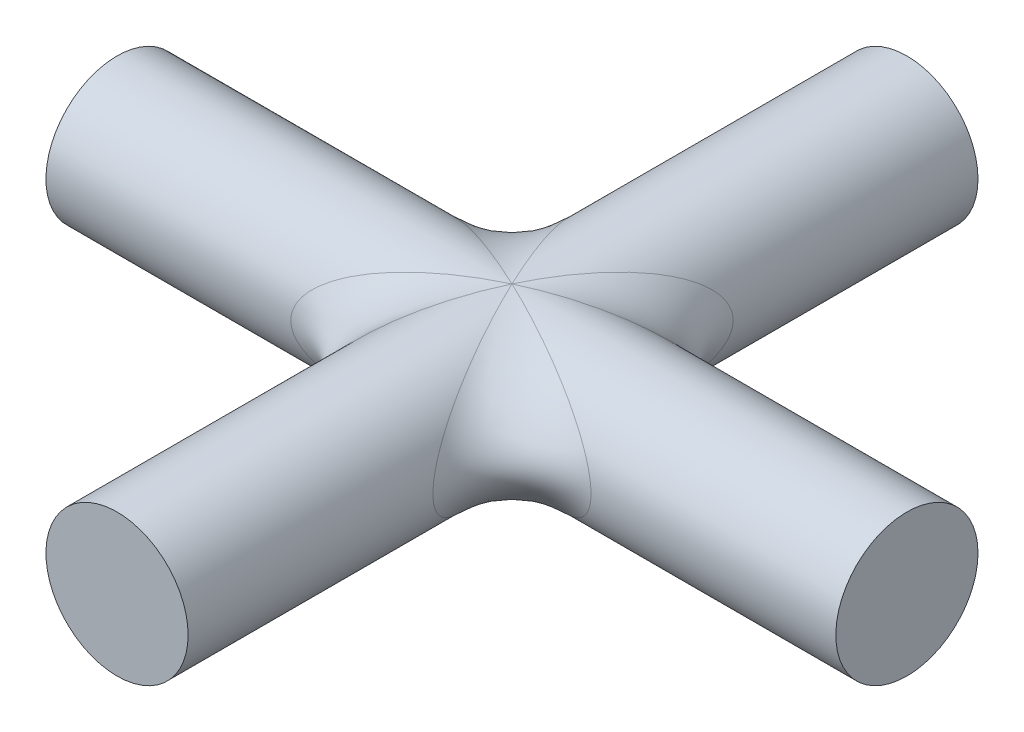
ISO-10303-21;
HEADER;
FILE_DESCRIPTION(('STEP AP214'),'2;1');
FILE_NAME('part.step','',(''),(''),'','','');
FILE_SCHEMA(('AUTOMOTIVE_DESIGN { 1 0 10303 214 1 1 1 1 }'));
ENDSEC;
DATA;
#1=APPLICATION_CONTEXT('core data for automotive mechanical design processes');
#2=APPLICATION_PROTOCOL_DEFINITION('international standard','automotive_design',2000,#1);
#3=PRODUCT_CONTEXT('',#1,'mechanical');
#4=PRODUCT('Part','Part','',(#3));
#5=PRODUCT_RELATED_PRODUCT_CATEGORY('part','',(#4));
#6=PRODUCT_DEFINITION_FORMATION('','',#4);
#7=PRODUCT_DEFINITION_CONTEXT('part definition',#1,'design');
#8=PRODUCT_DEFINITION('design','',#6,#7);
#9=PRODUCT_DEFINITION_SHAPE('','',#8);
#10=(LENGTH_UNIT() NAMED_UNIT(*) SI_UNIT(.MILLI.,.METRE.));
#11=(NAMED_UNIT(*) PLANE_ANGLE_UNIT() SI_UNIT($,.RADIAN.));
#12=(NAMED_UNIT(*) SI_UNIT($,.STERADIAN.) SOLID_ANGLE_UNIT());
#13=UNCERTAINTY_MEASURE_WITH_UNIT(LENGTH_MEASURE(1.E-05),#10,'distance_accuracy_value','');
#14=(GEOMETRIC_REPRESENTATION_CONTEXT(3) GLOBAL_UNCERTAINTY_ASSIGNED_CONTEXT((#13)) GLOBAL_UNIT_ASSIGNED_CONTEXT((#10,
#11,#12)) REPRESENTATION_CONTEXT('',''));
#15=CARTESIAN_POINT('',(0.,0.,0.));
#16=DIRECTION('',(0.,0.,1.));
#17=DIRECTION('',(1.,0.,0.));
#18=AXIS2_PLACEMENT_3D('',#15,#16,#17);
#19=CARTESIAN_POINT('',(12.7,0.,0.));
#20=DIRECTION('',(-1.,0.,0.));
#21=DIRECTION('',(0.,0.,1.));
#22=AXIS2_PLACEMENT_3D('',#19,#20,#21);
#23=CYLINDRICAL_SURFACE('',#22,2.286);
#24=CARTESIAN_POINT('',(12.7,0.,0.));
#25=DIRECTION('',(1.,0.,0.));
#26=DIRECTION('',(0.,0.,-1.));
#27=AXIS2_PLACEMENT_3D('',#24,#25,#26);
#28=CIRCLE('',#27,2.286);
#29=CARTESIAN_POINT('',(12.7,0.,-2.286));
#30=VERTEX_POINT('',#29);
#31=EDGE_CURVE('E89',#30,#30,#28,.T.);
#32=ORIENTED_EDGE('',*,*,#31,.F.);
#33=EDGE_LOOP('',(#32));
#34=FACE_BOUND('',#33,.T.);
#35=CARTESIAN_POINT('',(0.,0.,0.));
#36=DIRECTION('',(-0.428086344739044,0.,0.903737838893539));
#37=DIRECTION('',(-0.903737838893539,0.,-0.428086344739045));
#38=AXIS2_PLACEMENT_3D('',#35,#36,#37);
#39=ELLIPSE('',#38,5.34004419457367,2.286);
#40=CARTESIAN_POINT('',(0.,2.286,0.));
#41=VERTEX_POINT('',#40);
#42=CARTESIAN_POINT('',(0.,-2.286,0.));
#43=VERTEX_POINT('',#42);
#44=EDGE_CURVE('E72',#41,#43,#39,.F.);
#45=ORIENTED_EDGE('',*,*,#44,.T.);
#46=CARTESIAN_POINT('',(0.,0.,0.));
#47=DIRECTION('',(0.428086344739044,0.,0.903737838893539));
#48=DIRECTION('',(0.903737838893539,0.,-0.428086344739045));
#49=AXIS2_PLACEMENT_3D('',#46,#47,#48);
#50=ELLIPSE('',#49,5.34004419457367,2.286);
#51=EDGE_CURVE('E65',#43,#41,#50,.T.);
#52=ORIENTED_EDGE('',*,*,#51,.T.);
#53=EDGE_LOOP('',(#45,#52));
#54=FACE_BOUND('',#53,.T.);
#55=ADVANCED_FACE('F32',(#34,#54),#23,.T.);
#56=CARTESIAN_POINT('',(12.7,0.,0.));
#57=DIRECTION('',(1.,0.,0.));
#58=DIRECTION('',(0.,0.,-1.));
#59=AXIS2_PLACEMENT_3D('',#56,#57,#58);
#60=PLANE('',#59);
#61=ORIENTED_EDGE('',*,*,#31,.T.);
#62=EDGE_LOOP('',(#61));
#63=FACE_BOUND('',#62,.T.);
#64=ADVANCED_FACE('F116',(#63),#60,.T.);
#65=CARTESIAN_POINT('',(0.,0.,-12.7));
#66=DIRECTION('',(0.,0.,1.));
#67=DIRECTION('',(1.,0.,0.));
#68=AXIS2_PLACEMENT_3D('',#65,#66,#67);
#69=PLANE('',#68);
#70=CARTESIAN_POINT('',(0.,0.,-12.7));
#71=DIRECTION('',(0.,0.,1.));
#72=DIRECTION('',(1.,0.,0.));
#73=AXIS2_PLACEMENT_3D('',#70,#71,#72);
#74=CIRCLE('',#73,2.286);
#75=CARTESIAN_POINT('',(2.286,0.,-12.7));
#76=VERTEX_POINT('',#75);
#77=EDGE_CURVE('E146',#76,#76,#74,.T.);
#78=ORIENTED_EDGE('',*,*,#77,.F.);
#79=EDGE_LOOP('',(#78));
#80=FACE_BOUND('',#79,.T.);
#81=ADVANCED_FACE('F114',(#80),#69,.F.);
#82=CARTESIAN_POINT('',(0.,0.,12.7));
#83=DIRECTION('',(0.,0.,-1.));
#84=DIRECTION('',(-1.,0.,0.));
#85=AXIS2_PLACEMENT_3D('',#82,#83,#84);
#86=CYLINDRICAL_SURFACE('',#85,2.286);
#87=ORIENTED_EDGE('',*,*,#77,.T.);
#88=EDGE_LOOP('',(#87));
#89=FACE_BOUND('',#88,.T.);
#90=CARTESIAN_POINT('',(0.,0.,0.));
#91=DIRECTION('',(-0.903737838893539,0.,0.428086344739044));
#92=DIRECTION('',(-0.428086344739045,0.,-0.903737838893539));
#93=AXIS2_PLACEMENT_3D('',#90,#91,#92);
#94=ELLIPSE('',#93,5.34004419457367,2.286);
#95=EDGE_CURVE('E85',#43,#41,#94,.F.);
#96=ORIENTED_EDGE('',*,*,#95,.T.);
#97=CARTESIAN_POINT('',(0.,0.,0.));
#98=DIRECTION('',(0.903737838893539,0.,0.428086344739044));
#99=DIRECTION('',(0.428086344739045,0.,-0.903737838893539));
#100=AXIS2_PLACEMENT_3D('',#97,#98,#99);
#101=ELLIPSE('',#100,5.34004419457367,2.286);
#102=EDGE_CURVE('E68',#41,#43,#101,.F.);
#103=ORIENTED_EDGE('',*,*,#102,.T.);
#104=EDGE_LOOP('',(#96,#103));
#105=FACE_BOUND('',#104,.T.);
#106=ADVANCED_FACE('F84',(#89,#105),#86,.T.);
#107=CARTESIAN_POINT('',(-12.7,0.,0.));
#108=DIRECTION('',(1.,0.,0.));
#109=DIRECTION('',(0.,0.,-1.));
#110=AXIS2_PLACEMENT_3D('',#107,#108,#109);
#111=PLANE('',#110);
#112=CARTESIAN_POINT('',(-12.7,0.,0.));
#113=DIRECTION('',(1.,0.,0.));
#114=DIRECTION('',(0.,0.,-1.));
#115=AXIS2_PLACEMENT_3D('',#112,#113,#114);
#116=CIRCLE('',#115,2.286);
#117=CARTESIAN_POINT('',(-12.7,0.,-2.286));
#118=VERTEX_POINT('',#117);
#119=EDGE_CURVE('E92',#118,#118,#116,.T.);
#120=ORIENTED_EDGE('',*,*,#119,.F.);
#121=EDGE_LOOP('',(#120));
#122=FACE_BOUND('',#121,.T.);
#123=ADVANCED_FACE('F136',(#122),#111,.F.);
#124=ORIENTED_EDGE('',*,*,#119,.T.);
#125=EDGE_LOOP('',(#124));
#126=FACE_BOUND('',#125,.T.);
#127=CARTESIAN_POINT('',(0.,0.,0.));
#128=DIRECTION('',(-0.428086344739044,0.,0.903737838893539));
#129=DIRECTION('',(-0.903737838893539,0.,-0.428086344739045));
#130=AXIS2_PLACEMENT_3D('',#127,#128,#129);
#131=ELLIPSE('',#130,5.34004419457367,2.286);
#132=EDGE_CURVE('E45',#41,#43,#131,.T.);
#133=ORIENTED_EDGE('',*,*,#132,.T.);
#134=CARTESIAN_POINT('',(0.,0.,0.));
#135=DIRECTION('',(0.428086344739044,0.,0.903737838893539));
#136=DIRECTION('',(0.903737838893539,0.,-0.428086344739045));
#137=AXIS2_PLACEMENT_3D('',#134,#135,#136);
#138=ELLIPSE('',#137,5.34004419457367,2.286);
#139=EDGE_CURVE('E11',#43,#41,#138,.F.);
#140=ORIENTED_EDGE('',*,*,#139,.T.);
#141=EDGE_LOOP('',(#133,#140));
#142=FACE_BOUND('',#141,.T.);
#143=ADVANCED_FACE('F74',(#126,#142),#23,.T.);
#144=CARTESIAN_POINT('',(0.,0.,12.7));
#145=DIRECTION('',(0.,0.,1.));
#146=DIRECTION('',(1.,0.,0.));
#147=AXIS2_PLACEMENT_3D('',#144,#145,#146);
#148=CIRCLE('',#147,2.286);
#149=CARTESIAN_POINT('',(2.286,0.,12.7));
#150=VERTEX_POINT('',#149);
#151=EDGE_CURVE('E144',#150,#150,#148,.T.);
#152=ORIENTED_EDGE('',*,*,#151,.F.);
#153=EDGE_LOOP('',(#152));
#154=FACE_BOUND('',#153,.T.);
#155=CARTESIAN_POINT('',(0.,0.,0.));
#156=DIRECTION('',(0.903737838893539,0.,0.428086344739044));
#157=DIRECTION('',(0.428086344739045,0.,-0.903737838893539));
#158=AXIS2_PLACEMENT_3D('',#155,#156,#157);
#159=ELLIPSE('',#158,5.34004419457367,2.286);
#160=EDGE_CURVE('E59',#41,#43,#159,.T.);
#161=ORIENTED_EDGE('',*,*,#160,.T.);
#162=CARTESIAN_POINT('',(0.,0.,0.));
#163=DIRECTION('',(-0.903737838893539,0.,0.428086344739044));
#164=DIRECTION('',(-0.428086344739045,0.,-0.903737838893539));
#165=AXIS2_PLACEMENT_3D('',#162,#163,#164);
#166=ELLIPSE('',#165,5.34004419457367,2.286);
#167=EDGE_CURVE('E75',#43,#41,#166,.T.);
#168=ORIENTED_EDGE('',*,*,#167,.T.);
#169=EDGE_LOOP('',(#161,#168));
#170=FACE_BOUND('',#169,.T.);
#171=ADVANCED_FACE('F78',(#154,#170),#86,.T.);
#172=CARTESIAN_POINT('',(0.,0.,12.7));
#173=DIRECTION('',(0.,0.,1.));
#174=DIRECTION('',(1.,0.,0.));
#175=AXIS2_PLACEMENT_3D('',#172,#173,#174);
#176=PLANE('',#175);
#177=ORIENTED_EDGE('',*,*,#151,.T.);
#178=EDGE_LOOP('',(#177));
#179=FACE_BOUND('',#178,.T.);
#180=ADVANCED_FACE('F104',(#179),#176,.T.);
#181=CARTESIAN_POINT('',(0.,2.286,0.));
#182=CARTESIAN_POINT('',(0.,2.286,0.));
#183=CARTESIAN_POINT('',(0.,2.286,0.));
#184=CARTESIAN_POINT('',(0.0995890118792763,2.28595993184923,-0.210243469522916));
#185=CARTESIAN_POINT('',(0.154947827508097,2.28631550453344,-0.154947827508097));
#186=CARTESIAN_POINT('',(0.210243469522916,2.28595993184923,-0.0995890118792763));
#187=CARTESIAN_POINT('',(0.199203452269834,2.27948891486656,-0.420540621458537));
#188=CARTESIAN_POINT('',(0.310320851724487,2.2722519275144,-0.310320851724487));
#189=CARTESIAN_POINT('',(0.420540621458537,2.27948891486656,-0.199203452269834));
#190=CARTESIAN_POINT('',(0.396719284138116,2.25350788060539,-0.837518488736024));
#191=CARTESIAN_POINT('',(0.614699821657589,2.21743937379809,-0.61469982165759));
#192=CARTESIAN_POINT('',(0.837518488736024,2.25350788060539,-0.396719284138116));
#193=CARTESIAN_POINT('',(0.494628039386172,2.23410916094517,-1.04421474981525));
#194=CARTESIAN_POINT('',(0.764584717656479,2.17661121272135,-0.764584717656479));
#195=CARTESIAN_POINT('',(1.04421474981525,2.23410916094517,-0.494628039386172));
#196=CARTESIAN_POINT('',(0.687065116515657,2.18253985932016,-1.45047080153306));
#197=CARTESIAN_POINT('',(1.05254183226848,2.06985742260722,-1.05254183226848));
#198=CARTESIAN_POINT('',(1.45047080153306,2.18253985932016,-0.687065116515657));
#199=CARTESIAN_POINT('',(0.781622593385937,2.15058895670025,-1.65009214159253));
#200=CARTESIAN_POINT('',(1.19148213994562,2.00377565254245,-1.19148213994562));
#201=CARTESIAN_POINT('',(1.65009214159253,2.15058895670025,-0.781622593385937));
#202=CARTESIAN_POINT('',(0.965710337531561,2.07433916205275,-2.03872182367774));
#203=CARTESIAN_POINT('',(1.4522802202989,1.85002940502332,-1.4522802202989));
#204=CARTESIAN_POINT('',(2.03872182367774,2.07433916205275,-0.965710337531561));
#205=CARTESIAN_POINT('',(1.05530706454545,2.0303638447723,-2.22787046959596));
#206=CARTESIAN_POINT('',(1.57497814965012,1.76213109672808,-1.57497814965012));
#207=CARTESIAN_POINT('',(2.22787046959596,2.0303638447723,-1.05530706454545));
#208=CARTESIAN_POINT('',(1.22790166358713,1.93071585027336,-2.5922368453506));
#209=CARTESIAN_POINT('',(1.79838930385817,1.5698860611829,-1.79838930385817));
#210=CARTESIAN_POINT('',(2.5922368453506,1.93071585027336,-1.22790166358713));
#211=CARTESIAN_POINT('',(1.3110188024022,1.87546005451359,-2.76770636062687));
#212=CARTESIAN_POINT('',(1.89989369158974,1.46523612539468,-1.89989369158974));
#213=CARTESIAN_POINT('',(2.76770636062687,1.87546005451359,-1.3110188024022));
#214=CARTESIAN_POINT('',(1.46917579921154,1.75410148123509,-3.10159335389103));
#215=CARTESIAN_POINT('',(2.0767997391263,1.2467527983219,-2.0767997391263));
#216=CARTESIAN_POINT('',(3.10159335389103,1.75410148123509,-1.46917579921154));
#217=CARTESIAN_POINT('',(1.5444025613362,1.68849058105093,-3.26040540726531));
#218=CARTESIAN_POINT('',(2.15291515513,1.13256557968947,-2.15291515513));
#219=CARTESIAN_POINT('',(3.26040540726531,1.68849058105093,-1.5444025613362));
#220=CARTESIAN_POINT('',(1.6854204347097,1.54747087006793,-3.55810980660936));
#221=CARTESIAN_POINT('',(2.27645124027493,0.904607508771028,-2.27645124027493));
#222=CARTESIAN_POINT('',(3.55810980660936,1.54747087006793,-1.6854204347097));
#223=CARTESIAN_POINT('',(1.75147699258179,1.47259855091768,-3.69756253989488));
#224=CARTESIAN_POINT('',(2.3244785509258,0.790466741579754,-2.3244785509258));
#225=CARTESIAN_POINT('',(3.69756253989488,1.47259855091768,-1.75147699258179));
#226=CARTESIAN_POINT('',(1.87294191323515,1.31429814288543,-3.95398848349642));
#227=CARTESIAN_POINT('',(2.39194381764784,0.574280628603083,-2.39194381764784));
#228=CARTESIAN_POINT('',(3.95398848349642,1.31429814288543,-1.87294191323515));
#229=CARTESIAN_POINT('',(1.92869543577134,1.23140588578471,-4.07169036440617));
#230=CARTESIAN_POINT('',(2.41186019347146,0.471896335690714,-2.41186019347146));
#231=CARTESIAN_POINT('',(4.07169036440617,1.23140588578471,-1.92869543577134));
#232=CARTESIAN_POINT('',(2.028518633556,1.05849848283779,-4.28242822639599));
#233=CARTESIAN_POINT('',(2.42737400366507,0.291450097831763,-2.42737400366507));
#234=CARTESIAN_POINT('',(4.28242822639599,1.05849848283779,-2.028518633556));
#235=CARTESIAN_POINT('',(2.07299557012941,0.968959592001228,-4.37632398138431));
#236=CARTESIAN_POINT('',(2.42332089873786,0.213124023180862,-2.42332089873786));
#237=CARTESIAN_POINT('',(4.37632398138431,0.968959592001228,-2.07299557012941));
#238=CARTESIAN_POINT('',(2.14944639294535,0.784375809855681,-4.53772016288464));
#239=CARTESIAN_POINT('',(2.40032956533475,0.0899469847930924,-2.40032956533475));
#240=CARTESIAN_POINT('',(4.53772016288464,0.784375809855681,-2.14944639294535));
#241=CARTESIAN_POINT('',(2.18184360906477,0.689686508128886,-4.60611428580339));
#242=CARTESIAN_POINT('',(2.38163398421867,0.0449196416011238,-2.38163398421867));
#243=CARTESIAN_POINT('',(4.60611428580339,0.689686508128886,-2.18184360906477));
#244=CARTESIAN_POINT('',(2.23358068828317,0.496577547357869,-4.71533700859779));
#245=CARTESIAN_POINT('',(2.34283679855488,-0.011028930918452,-2.34283679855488));
#246=CARTESIAN_POINT('',(4.71533700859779,0.496577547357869,-2.23358068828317));
#247=CARTESIAN_POINT('',(2.25328340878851,0.39835526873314,-4.75693164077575));
#248=CARTESIAN_POINT('',(2.32289795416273,-0.0220726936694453,-2.32289795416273));
#249=CARTESIAN_POINT('',(4.75693164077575,0.39835526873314,-2.25328340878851));
#250=CARTESIAN_POINT('',(2.27938659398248,0.200050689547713,-4.81203836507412));
#251=CARTESIAN_POINT('',(2.29443556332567,-0.0220195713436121,-2.29443556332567));
#252=CARTESIAN_POINT('',(4.81203836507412,0.200050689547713,-2.27938659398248));
#253=CARTESIAN_POINT('',(2.286,0.100025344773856,-4.826));
#254=CARTESIAN_POINT('',(2.286,-0.0110419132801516,-2.286));
#255=CARTESIAN_POINT('',(4.826,0.100025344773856,-2.286));
#256=CARTESIAN_POINT('',(2.286,-0.100025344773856,-4.826));
#257=CARTESIAN_POINT('',(2.286,0.0110419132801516,-2.286));
#258=CARTESIAN_POINT('',(4.826,-0.100025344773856,-2.286));
#259=CARTESIAN_POINT('',(2.27938659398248,-0.200050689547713,-4.81203836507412));
#260=CARTESIAN_POINT('',(2.29443556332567,0.0220195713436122,-2.29443556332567));
#261=CARTESIAN_POINT('',(4.81203836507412,-0.200050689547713,-2.27938659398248));
#262=CARTESIAN_POINT('',(2.25328340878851,-0.398355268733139,-4.75693164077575));
#263=CARTESIAN_POINT('',(2.32289795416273,0.0220726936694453,-2.32289795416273));
#264=CARTESIAN_POINT('',(4.75693164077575,-0.398355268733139,-2.25328340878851));
#265=CARTESIAN_POINT('',(2.23358068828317,-0.496577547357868,-4.71533700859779));
#266=CARTESIAN_POINT('',(2.34283679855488,0.0110289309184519,-2.34283679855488));
#267=CARTESIAN_POINT('',(4.71533700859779,-0.496577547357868,-2.23358068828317));
#268=CARTESIAN_POINT('',(2.18184360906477,-0.689686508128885,-4.60611428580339));
#269=CARTESIAN_POINT('',(2.38163398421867,-0.0449196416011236,-2.38163398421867));
#270=CARTESIAN_POINT('',(4.60611428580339,-0.689686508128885,-2.18184360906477));
#271=CARTESIAN_POINT('',(2.14944639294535,-0.784375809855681,-4.53772016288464));
#272=CARTESIAN_POINT('',(2.40032956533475,-0.0899469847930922,-2.40032956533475));
#273=CARTESIAN_POINT('',(4.53772016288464,-0.784375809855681,-2.14944639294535));
#274=CARTESIAN_POINT('',(2.07299557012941,-0.968959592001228,-4.37632398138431));
#275=CARTESIAN_POINT('',(2.42332089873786,-0.213124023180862,-2.42332089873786));
#276=CARTESIAN_POINT('',(4.37632398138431,-0.968959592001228,-2.07299557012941));
#277=CARTESIAN_POINT('',(2.028518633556,-1.05849848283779,-4.28242822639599));
#278=CARTESIAN_POINT('',(2.42737400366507,-0.291450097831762,-2.42737400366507));
#279=CARTESIAN_POINT('',(4.28242822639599,-1.05849848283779,-2.028518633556));
#280=CARTESIAN_POINT('',(1.92869543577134,-1.23140588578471,-4.07169036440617));
#281=CARTESIAN_POINT('',(2.41186019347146,-0.471896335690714,-2.41186019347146));
#282=CARTESIAN_POINT('',(4.07169036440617,-1.23140588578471,-1.92869543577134));
#283=CARTESIAN_POINT('',(1.87294191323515,-1.31429814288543,-3.95398848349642));
#284=CARTESIAN_POINT('',(2.39194381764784,-0.574280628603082,-2.39194381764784));
#285=CARTESIAN_POINT('',(3.95398848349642,-1.31429814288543,-1.87294191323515));
#286=CARTESIAN_POINT('',(1.75147699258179,-1.47259855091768,-3.69756253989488));
#287=CARTESIAN_POINT('',(2.3244785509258,-0.790466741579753,-2.3244785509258));
#288=CARTESIAN_POINT('',(3.69756253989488,-1.47259855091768,-1.75147699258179));
#289=CARTESIAN_POINT('',(1.6854204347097,-1.54747087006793,-3.55810980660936));
#290=CARTESIAN_POINT('',(2.27645124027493,-0.904607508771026,-2.27645124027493));
#291=CARTESIAN_POINT('',(3.55810980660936,-1.54747087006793,-1.6854204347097));
#292=CARTESIAN_POINT('',(1.5444025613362,-1.68849058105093,-3.26040540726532));
#293=CARTESIAN_POINT('',(2.15291515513,-1.13256557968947,-2.15291515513));
#294=CARTESIAN_POINT('',(3.26040540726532,-1.68849058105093,-1.5444025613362));
#295=CARTESIAN_POINT('',(1.46917579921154,-1.75410148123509,-3.10159335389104));
#296=CARTESIAN_POINT('',(2.0767997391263,-1.2467527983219,-2.0767997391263));
#297=CARTESIAN_POINT('',(3.10159335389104,-1.75410148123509,-1.46917579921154));
#298=CARTESIAN_POINT('',(1.3110188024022,-1.87546005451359,-2.76770636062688));
#299=CARTESIAN_POINT('',(1.89989369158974,-1.46523612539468,-1.89989369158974));
#300=CARTESIAN_POINT('',(2.76770636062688,-1.87546005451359,-1.3110188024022));
#301=CARTESIAN_POINT('',(1.22790166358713,-1.93071585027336,-2.5922368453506));
#302=CARTESIAN_POINT('',(1.79838930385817,-1.5698860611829,-1.79838930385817));
#303=CARTESIAN_POINT('',(2.5922368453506,-1.93071585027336,-1.22790166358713));
#304=CARTESIAN_POINT('',(1.05530706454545,-2.0303638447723,-2.22787046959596));
#305=CARTESIAN_POINT('',(1.57497814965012,-1.76213109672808,-1.57497814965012));
#306=CARTESIAN_POINT('',(2.22787046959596,-2.0303638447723,-1.05530706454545));
#307=CARTESIAN_POINT('',(0.965710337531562,-2.07433916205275,-2.03872182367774));
#308=CARTESIAN_POINT('',(1.4522802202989,-1.85002940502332,-1.4522802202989));
#309=CARTESIAN_POINT('',(2.03872182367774,-2.07433916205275,-0.965710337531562));
#310=CARTESIAN_POINT('',(0.781622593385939,-2.15058895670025,-1.65009214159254));
#311=CARTESIAN_POINT('',(1.19148213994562,-2.00377565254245,-1.19148213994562));
#312=CARTESIAN_POINT('',(1.65009214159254,-2.15058895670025,-0.781622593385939));
#313=CARTESIAN_POINT('',(0.687065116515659,-2.18253985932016,-1.45047080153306));
#314=CARTESIAN_POINT('',(1.05254183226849,-2.06985742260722,-1.05254183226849));
#315=CARTESIAN_POINT('',(1.45047080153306,-2.18253985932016,-0.687065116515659));
#316=CARTESIAN_POINT('',(0.494628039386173,-2.23410916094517,-1.04421474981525));
#317=CARTESIAN_POINT('',(0.764584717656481,-2.17661121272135,-0.764584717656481));
#318=CARTESIAN_POINT('',(1.04421474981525,-2.23410916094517,-0.494628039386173));
#319=CARTESIAN_POINT('',(0.396719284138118,-2.25350788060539,-0.837518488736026));
#320=CARTESIAN_POINT('',(0.614699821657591,-2.21743937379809,-0.614699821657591));
#321=CARTESIAN_POINT('',(0.837518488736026,-2.25350788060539,-0.396719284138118));
#322=CARTESIAN_POINT('',(0.199203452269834,-2.27948891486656,-0.420540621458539));
#323=CARTESIAN_POINT('',(0.310320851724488,-2.2722519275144,-0.310320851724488));
#324=CARTESIAN_POINT('',(0.420540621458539,-2.27948891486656,-0.199203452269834));
#325=CARTESIAN_POINT('',(0.0995890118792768,-2.28595993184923,-0.210243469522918));
#326=CARTESIAN_POINT('',(0.154947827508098,-2.28631550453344,-0.154947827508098));
#327=CARTESIAN_POINT('',(0.210243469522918,-2.28595993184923,-0.0995890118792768));
#328=CARTESIAN_POINT('',(0.,-2.286,0.));
#329=CARTESIAN_POINT('',(0.,-2.286,0.));
#330=CARTESIAN_POINT('',(0.,-2.286,0.));
#331=(BOUNDED_SURFACE() B_SPLINE_SURFACE(3,2,((#181,#182,#183),(#184,#185,#186),(#187,#188,
#189),(#190,#191,#192),(#193,#194,#195),(#196,#197,#198),(#199,#200,#201),(#202,#203,#204),
(#205,#206,#207),(#208,#209,#210),(#211,#212,#213),(#214,#215,#216),(#217,#218,#219),(#220,#221,
#222),(#223,#224,#225),(#226,#227,#228),(#229,#230,#231),(#232,#233,#234),(#235,#236,#237),
(#238,#239,#240),(#241,#242,#243),(#244,#245,#246),(#247,#248,#249),(#250,#251,#252),(#253,#254,
#255),(#256,#257,#258),(#259,#260,#261),(#262,#263,#264),(#265,#266,#267),(#268,#269,#270),
(#271,#272,#273),(#274,#275,#276),(#277,#278,#279),(#280,#281,#282),(#283,#284,#285),(#286,#287,
#288),(#289,#290,#291),(#292,#293,#294),(#295,#296,#297),(#298,#299,#300),(#301,#302,#303),
(#304,#305,#306),(#307,#308,#309),(#310,#311,#312),(#313,#314,#315),(#316,#317,#318),(#319,#320,
#321),(#322,#323,#324),(#325,#326,#327),(#328,#329,#330)),.UNSPECIFIED.,.F.,.F.,
.F.) B_SPLINE_SURFACE_WITH_KNOTS((4,2,2,2,2,2,2,2,2,2,2,2,2,2,2,2,2,2,2,2,2,2,2,2,4),(3,3),(0.,
0.89179680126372,1.77601342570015,2.64539912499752,3.4933680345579,4.31434603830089,
5.10413218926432,5.86027177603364,6.58242436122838,7.27268370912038,7.93576571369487,
8.57893769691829,9.21155741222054,9.84417712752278,10.4873491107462,11.1504311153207,
11.8406904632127,12.5628430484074,13.3189826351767,14.1087687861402,14.9297467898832,
15.7777156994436,16.6471013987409,17.5313180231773,18.4231148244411),(0.,1.),
.UNSPECIFIED.) GEOMETRIC_REPRESENTATION_ITEM() RATIONAL_B_SPLINE_SURFACE(((1.,1.,1.),(1.,
1.00000566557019,1.),(1.,0.998576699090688,1.),(1.,0.992910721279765,1.),(1.,0.988697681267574,
1.),(1.,0.97761712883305,1.),(1.,0.970795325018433,1.),(1.,0.954789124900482,1.),(1.,
0.945667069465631,1.),(1.,0.925487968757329,1.),(1.,0.914501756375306,1.),(1.,0.891169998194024,
1.),(1.,0.878891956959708,1.),(1.,0.853706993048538,1.),(1.,0.84084914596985,1.),(1.,
0.815387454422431,1.),(1.,0.802798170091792,1.),(1.,0.778880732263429,1.),(1.,0.767521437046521,
1.),(1.,0.747118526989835,1.),(1.,0.738001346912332,1.),(1.,0.723039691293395,1.),(1.,
0.717105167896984,1.),(1.,0.709170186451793,1.),(1.,0.707106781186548,1.),(1.,0.707106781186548,
1.),(1.,0.709170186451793,1.),(1.,0.717105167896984,1.),(1.,0.723039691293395,1.),(1.,
0.738001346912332,1.),(1.,0.747118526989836,1.),(1.,0.767521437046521,1.),(1.,0.778880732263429,
1.),(1.,0.802798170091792,1.),(1.,0.815387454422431,1.),(1.,0.84084914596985,1.),(1.,
0.853706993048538,1.),(1.,0.878891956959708,1.),(1.,0.891169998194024,1.),(1.,0.914501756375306,
1.),(1.,0.925487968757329,1.),(1.,0.945667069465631,1.),(1.,0.954789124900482,1.),(1.,
0.970795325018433,1.),(1.,0.97761712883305,1.),(1.,0.988697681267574,1.),(1.,0.992910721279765,
1.),(1.,0.998576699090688,1.),(1.,1.00000566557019,1.),(1.,1.,1.))) REPRESENTATION_ITEM('') SURFACE());
#332=ORIENTED_EDGE('',*,*,#102,.F.);
#333=ORIENTED_EDGE('',*,*,#51,.F.);
#334=EDGE_LOOP('',(#332,#333));
#335=FACE_BOUND('',#334,.T.);
#336=ADVANCED_FACE('F66',(#335),#331,.F.);
#337=CARTESIAN_POINT('',(0.,2.286,0.));
#338=CARTESIAN_POINT('',(0.,2.286,0.));
#339=CARTESIAN_POINT('',(0.,2.286,0.));
#340=CARTESIAN_POINT('',(0.210243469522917,2.28595993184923,0.0995890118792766));
#341=CARTESIAN_POINT('',(0.154947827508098,2.28631550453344,0.154947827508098));
#342=CARTESIAN_POINT('',(0.0995890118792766,2.28595993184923,0.210243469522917));
#343=CARTESIAN_POINT('',(0.420540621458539,2.27948891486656,0.199203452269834));
#344=CARTESIAN_POINT('',(0.310320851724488,2.2722519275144,0.310320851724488));
#345=CARTESIAN_POINT('',(0.199203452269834,2.27948891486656,0.420540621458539));
#346=CARTESIAN_POINT('',(0.837518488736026,2.25350788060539,0.396719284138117));
#347=CARTESIAN_POINT('',(0.614699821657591,2.21743937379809,0.614699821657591));
#348=CARTESIAN_POINT('',(0.396719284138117,2.25350788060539,0.837518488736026));
#349=CARTESIAN_POINT('',(1.04421474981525,2.23410916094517,0.494628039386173));
#350=CARTESIAN_POINT('',(0.764584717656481,2.17661121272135,0.764584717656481));
#351=CARTESIAN_POINT('',(0.494628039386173,2.23410916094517,1.04421474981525));
#352=CARTESIAN_POINT('',(1.45047080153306,2.18253985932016,0.687065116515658));
#353=CARTESIAN_POINT('',(1.05254183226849,2.06985742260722,1.05254183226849));
#354=CARTESIAN_POINT('',(0.687065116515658,2.18253985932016,1.45047080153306));
#355=CARTESIAN_POINT('',(1.65009214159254,2.15058895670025,0.781622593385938));
#356=CARTESIAN_POINT('',(1.19148213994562,2.00377565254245,1.19148213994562));
#357=CARTESIAN_POINT('',(0.781622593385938,2.15058895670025,1.65009214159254));
#358=CARTESIAN_POINT('',(2.03872182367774,2.07433916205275,0.965710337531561));
#359=CARTESIAN_POINT('',(1.4522802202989,1.85002940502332,1.4522802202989));
#360=CARTESIAN_POINT('',(0.965710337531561,2.07433916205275,2.03872182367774));
#361=CARTESIAN_POINT('',(2.22787046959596,2.0303638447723,1.05530706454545));
#362=CARTESIAN_POINT('',(1.57497814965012,1.76213109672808,1.57497814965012));
#363=CARTESIAN_POINT('',(1.05530706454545,2.0303638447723,2.22787046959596));
#364=CARTESIAN_POINT('',(2.5922368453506,1.93071585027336,1.22790166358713));
#365=CARTESIAN_POINT('',(1.79838930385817,1.5698860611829,1.79838930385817));
#366=CARTESIAN_POINT('',(1.22790166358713,1.93071585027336,2.5922368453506));
#367=CARTESIAN_POINT('',(2.76770636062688,1.87546005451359,1.3110188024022));
#368=CARTESIAN_POINT('',(1.89989369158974,1.46523612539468,1.89989369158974));
#369=CARTESIAN_POINT('',(1.3110188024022,1.87546005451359,2.76770636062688));
#370=CARTESIAN_POINT('',(3.10159335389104,1.75410148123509,1.46917579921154));
#371=CARTESIAN_POINT('',(2.0767997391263,1.2467527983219,2.0767997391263));
#372=CARTESIAN_POINT('',(1.46917579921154,1.75410148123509,3.10159335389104));
#373=CARTESIAN_POINT('',(3.26040540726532,1.68849058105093,1.5444025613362));
#374=CARTESIAN_POINT('',(2.15291515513,1.13256557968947,2.15291515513));
#375=CARTESIAN_POINT('',(1.5444025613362,1.68849058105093,3.26040540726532));
#376=CARTESIAN_POINT('',(3.55810980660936,1.54747087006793,1.6854204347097));
#377=CARTESIAN_POINT('',(2.27645124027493,0.904607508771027,2.27645124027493));
#378=CARTESIAN_POINT('',(1.6854204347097,1.54747087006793,3.55810980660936));
#379=CARTESIAN_POINT('',(3.69756253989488,1.47259855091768,1.75147699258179));
#380=CARTESIAN_POINT('',(2.3244785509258,0.790466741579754,2.3244785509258));
#381=CARTESIAN_POINT('',(1.75147699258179,1.47259855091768,3.69756253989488));
#382=CARTESIAN_POINT('',(3.95398848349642,1.31429814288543,1.87294191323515));
#383=CARTESIAN_POINT('',(2.39194381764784,0.574280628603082,2.39194381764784));
#384=CARTESIAN_POINT('',(1.87294191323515,1.31429814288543,3.95398848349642));
#385=CARTESIAN_POINT('',(4.07169036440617,1.23140588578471,1.92869543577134));
#386=CARTESIAN_POINT('',(2.41186019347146,0.471896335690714,2.41186019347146));
#387=CARTESIAN_POINT('',(1.92869543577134,1.23140588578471,4.07169036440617));
#388=CARTESIAN_POINT('',(4.28242822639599,1.05849848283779,2.028518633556));
#389=CARTESIAN_POINT('',(2.42737400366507,0.291450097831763,2.42737400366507));
#390=CARTESIAN_POINT('',(2.028518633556,1.05849848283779,4.28242822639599));
#391=CARTESIAN_POINT('',(4.37632398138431,0.968959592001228,2.07299557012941));
#392=CARTESIAN_POINT('',(2.42332089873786,0.213124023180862,2.42332089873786));
#393=CARTESIAN_POINT('',(2.07299557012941,0.968959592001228,4.37632398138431));
#394=CARTESIAN_POINT('',(4.53772016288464,0.784375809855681,2.14944639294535));
#395=CARTESIAN_POINT('',(2.40032956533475,0.0899469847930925,2.40032956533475));
#396=CARTESIAN_POINT('',(2.14944639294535,0.784375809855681,4.53772016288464));
#397=CARTESIAN_POINT('',(4.60611428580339,0.689686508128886,2.18184360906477));
#398=CARTESIAN_POINT('',(2.38163398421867,0.0449196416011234,2.38163398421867));
#399=CARTESIAN_POINT('',(2.18184360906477,0.689686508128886,4.60611428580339));
#400=CARTESIAN_POINT('',(4.71533700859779,0.496577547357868,2.23358068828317));
#401=CARTESIAN_POINT('',(2.34283679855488,-0.0110289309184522,2.34283679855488));
#402=CARTESIAN_POINT('',(2.23358068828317,0.496577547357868,4.71533700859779));
#403=CARTESIAN_POINT('',(4.75693164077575,0.39835526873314,2.25328340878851));
#404=CARTESIAN_POINT('',(2.32289795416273,-0.0220726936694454,2.32289795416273));
#405=CARTESIAN_POINT('',(2.25328340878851,0.39835526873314,4.75693164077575));
#406=CARTESIAN_POINT('',(4.81203836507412,0.200050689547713,2.27938659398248));
#407=CARTESIAN_POINT('',(2.29443556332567,-0.0220195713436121,2.29443556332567));
#408=CARTESIAN_POINT('',(2.27938659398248,0.200050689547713,4.81203836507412));
#409=CARTESIAN_POINT('',(4.826,0.100025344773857,2.286));
#410=CARTESIAN_POINT('',(2.286,-0.0110419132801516,2.286));
#411=CARTESIAN_POINT('',(2.286,0.100025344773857,4.826));
#412=CARTESIAN_POINT('',(4.826,-0.100025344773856,2.286));
#413=CARTESIAN_POINT('',(2.286,0.0110419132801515,2.286));
#414=CARTESIAN_POINT('',(2.286,-0.100025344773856,4.826));
#415=CARTESIAN_POINT('',(4.81203836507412,-0.200050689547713,2.27938659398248));
#416=CARTESIAN_POINT('',(2.29443556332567,0.022019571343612,2.29443556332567));
#417=CARTESIAN_POINT('',(2.27938659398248,-0.200050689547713,4.81203836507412));
#418=CARTESIAN_POINT('',(4.75693164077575,-0.39835526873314,2.25328340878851));
#419=CARTESIAN_POINT('',(2.32289795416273,0.0220726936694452,2.32289795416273));
#420=CARTESIAN_POINT('',(2.25328340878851,-0.39835526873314,4.75693164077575));
#421=CARTESIAN_POINT('',(4.71533700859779,-0.496577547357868,2.23358068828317));
#422=CARTESIAN_POINT('',(2.34283679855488,0.0110289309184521,2.34283679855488));
#423=CARTESIAN_POINT('',(2.23358068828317,-0.496577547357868,4.71533700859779));
#424=CARTESIAN_POINT('',(4.60611428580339,-0.689686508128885,2.18184360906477));
#425=CARTESIAN_POINT('',(2.38163398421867,-0.0449196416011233,2.38163398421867));
#426=CARTESIAN_POINT('',(2.18184360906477,-0.689686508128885,4.60611428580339));
#427=CARTESIAN_POINT('',(4.53772016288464,-0.784375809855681,2.14944639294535));
#428=CARTESIAN_POINT('',(2.40032956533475,-0.0899469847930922,2.40032956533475));
#429=CARTESIAN_POINT('',(2.14944639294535,-0.784375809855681,4.53772016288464));
#430=CARTESIAN_POINT('',(4.37632398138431,-0.968959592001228,2.07299557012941));
#431=CARTESIAN_POINT('',(2.42332089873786,-0.213124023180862,2.42332089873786));
#432=CARTESIAN_POINT('',(2.07299557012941,-0.968959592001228,4.37632398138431));
#433=CARTESIAN_POINT('',(4.28242822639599,-1.05849848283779,2.028518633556));
#434=CARTESIAN_POINT('',(2.42737400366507,-0.291450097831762,2.42737400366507));
#435=CARTESIAN_POINT('',(2.028518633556,-1.05849848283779,4.28242822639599));
#436=CARTESIAN_POINT('',(4.07169036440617,-1.23140588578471,1.92869543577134));
#437=CARTESIAN_POINT('',(2.41186019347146,-0.471896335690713,2.41186019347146));
#438=CARTESIAN_POINT('',(1.92869543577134,-1.23140588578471,4.07169036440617));
#439=CARTESIAN_POINT('',(3.95398848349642,-1.31429814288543,1.87294191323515));
#440=CARTESIAN_POINT('',(2.39194381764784,-0.574280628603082,2.39194381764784));
#441=CARTESIAN_POINT('',(1.87294191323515,-1.31429814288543,3.95398848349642));
#442=CARTESIAN_POINT('',(3.69756253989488,-1.47259855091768,1.75147699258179));
#443=CARTESIAN_POINT('',(2.3244785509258,-0.790466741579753,2.3244785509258));
#444=CARTESIAN_POINT('',(1.75147699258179,-1.47259855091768,3.69756253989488));
#445=CARTESIAN_POINT('',(3.55810980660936,-1.54747087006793,1.6854204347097));
#446=CARTESIAN_POINT('',(2.27645124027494,-0.904607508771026,2.27645124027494));
#447=CARTESIAN_POINT('',(1.6854204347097,-1.54747087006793,3.55810980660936));
#448=CARTESIAN_POINT('',(3.26040540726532,-1.68849058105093,1.5444025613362));
#449=CARTESIAN_POINT('',(2.15291515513,-1.13256557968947,2.15291515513));
#450=CARTESIAN_POINT('',(1.5444025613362,-1.68849058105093,3.26040540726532));
#451=CARTESIAN_POINT('',(3.10159335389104,-1.75410148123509,1.46917579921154));
#452=CARTESIAN_POINT('',(2.0767997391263,-1.2467527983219,2.0767997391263));
#453=CARTESIAN_POINT('',(1.46917579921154,-1.75410148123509,3.10159335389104));
#454=CARTESIAN_POINT('',(2.76770636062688,-1.87546005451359,1.3110188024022));
#455=CARTESIAN_POINT('',(1.89989369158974,-1.46523612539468,1.89989369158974));
#456=CARTESIAN_POINT('',(1.3110188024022,-1.87546005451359,2.76770636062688));
#457=CARTESIAN_POINT('',(2.5922368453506,-1.93071585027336,1.22790166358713));
#458=CARTESIAN_POINT('',(1.79838930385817,-1.5698860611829,1.79838930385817));
#459=CARTESIAN_POINT('',(1.22790166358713,-1.93071585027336,2.5922368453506));
#460=CARTESIAN_POINT('',(2.22787046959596,-2.0303638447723,1.05530706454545));
#461=CARTESIAN_POINT('',(1.57497814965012,-1.76213109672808,1.57497814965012));
#462=CARTESIAN_POINT('',(1.05530706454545,-2.0303638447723,2.22787046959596));
#463=CARTESIAN_POINT('',(2.03872182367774,-2.07433916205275,0.965710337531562));
#464=CARTESIAN_POINT('',(1.4522802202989,-1.85002940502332,1.4522802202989));
#465=CARTESIAN_POINT('',(0.965710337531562,-2.07433916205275,2.03872182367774));
#466=CARTESIAN_POINT('',(1.65009214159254,-2.15058895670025,0.781622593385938));
#467=CARTESIAN_POINT('',(1.19148213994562,-2.00377565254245,1.19148213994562));
#468=CARTESIAN_POINT('',(0.781622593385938,-2.15058895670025,1.65009214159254));
#469=CARTESIAN_POINT('',(1.45047080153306,-2.18253985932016,0.687065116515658));
#470=CARTESIAN_POINT('',(1.05254183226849,-2.06985742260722,1.05254183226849));
#471=CARTESIAN_POINT('',(0.687065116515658,-2.18253985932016,1.45047080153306));
#472=CARTESIAN_POINT('',(1.04421474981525,-2.23410916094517,0.494628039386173));
#473=CARTESIAN_POINT('',(0.764584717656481,-2.17661121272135,0.764584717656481));
#474=CARTESIAN_POINT('',(0.494628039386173,-2.23410916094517,1.04421474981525));
#475=CARTESIAN_POINT('',(0.837518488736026,-2.25350788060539,0.396719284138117));
#476=CARTESIAN_POINT('',(0.614699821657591,-2.21743937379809,0.614699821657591));
#477=CARTESIAN_POINT('',(0.396719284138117,-2.25350788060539,0.837518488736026));
#478=CARTESIAN_POINT('',(0.420540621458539,-2.27948891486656,0.199203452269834));
#479=CARTESIAN_POINT('',(0.310320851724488,-2.2722519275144,0.310320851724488));
#480=CARTESIAN_POINT('',(0.199203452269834,-2.27948891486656,0.420540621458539));
#481=CARTESIAN_POINT('',(0.210243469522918,-2.28595993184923,0.0995890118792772));
#482=CARTESIAN_POINT('',(0.154947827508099,-2.28631550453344,0.154947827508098));
#483=CARTESIAN_POINT('',(0.0995890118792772,-2.28595993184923,0.210243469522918));
#484=CARTESIAN_POINT('',(0.,-2.286,0.));
#485=CARTESIAN_POINT('',(0.,-2.286,0.));
#486=CARTESIAN_POINT('',(0.,-2.286,0.));
#487=(BOUNDED_SURFACE() B_SPLINE_SURFACE(3,2,((#337,#338,#339),(#340,#341,#342),(#343,#344,
#345),(#346,#347,#348),(#349,#350,#351),(#352,#353,#354),(#355,#356,#357),(#358,#359,#360),
(#361,#362,#363),(#364,#365,#366),(#367,#368,#369),(#370,#371,#372),(#373,#374,#375),(#376,#377,
#378),(#379,#380,#381),(#382,#383,#384),(#385,#386,#387),(#388,#389,#390),(#391,#392,#393),
(#394,#395,#396),(#397,#398,#399),(#400,#401,#402),(#403,#404,#405),(#406,#407,#408),(#409,#410,
#411),(#412,#413,#414),(#415,#416,#417),(#418,#419,#420),(#421,#422,#423),(#424,#425,#426),
(#427,#428,#429),(#430,#431,#432),(#433,#434,#435),(#436,#437,#438),(#439,#440,#441),(#442,#443,
#444),(#445,#446,#447),(#448,#449,#450),(#451,#452,#453),(#454,#455,#456),(#457,#458,#459),
(#460,#461,#462),(#463,#464,#465),(#466,#467,#468),(#469,#470,#471),(#472,#473,#474),(#475,#476,
#477),(#478,#479,#480),(#481,#482,#483),(#484,#485,#486)),.UNSPECIFIED.,.F.,.F.,
.F.) B_SPLINE_SURFACE_WITH_KNOTS((4,2,2,2,2,2,2,2,2,2,2,2,2,2,2,2,2,2,2,2,2,2,2,2,4),(3,3),(0.,
0.891796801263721,1.77601342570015,2.64539912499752,3.49336803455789,4.3143460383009,
5.10413218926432,5.86027177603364,6.58242436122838,7.27268370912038,7.93576571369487,
8.57893769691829,9.21155741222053,9.84417712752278,10.4873491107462,11.1504311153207,
11.8406904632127,12.5628430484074,13.3189826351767,14.1087687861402,14.9297467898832,
15.7777156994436,16.6471013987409,17.5313180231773,18.4231148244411),(0.,1.),
.UNSPECIFIED.) GEOMETRIC_REPRESENTATION_ITEM() RATIONAL_B_SPLINE_SURFACE(((1.,1.,1.),(1.,
1.00000566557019,1.),(1.,0.998576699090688,1.),(1.,0.992910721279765,1.),(1.,0.988697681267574,
1.),(1.,0.97761712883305,1.),(1.,0.970795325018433,1.),(1.,0.954789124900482,1.),(1.,
0.945667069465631,1.),(1.,0.92548796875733,1.),(1.,0.914501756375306,1.),(1.,0.891169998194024,
1.),(1.,0.878891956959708,1.),(1.,0.853706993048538,1.),(1.,0.84084914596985,1.),(1.,
0.815387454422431,1.),(1.,0.802798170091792,1.),(1.,0.778880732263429,1.),(1.,0.767521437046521,
1.),(1.,0.747118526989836,1.),(1.,0.738001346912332,1.),(1.,0.723039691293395,1.),(1.,
0.717105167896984,1.),(1.,0.709170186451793,1.),(1.,0.707106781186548,1.),(1.,0.707106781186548,
1.),(1.,0.709170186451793,1.),(1.,0.717105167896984,1.),(1.,0.723039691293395,1.),(1.,
0.738001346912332,1.),(1.,0.747118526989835,1.),(1.,0.767521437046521,1.),(1.,0.778880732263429,
1.),(1.,0.802798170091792,1.),(1.,0.815387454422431,1.),(1.,0.84084914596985,1.),(1.,
0.853706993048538,1.),(1.,0.878891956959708,1.),(1.,0.891169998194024,1.),(1.,0.914501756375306,
1.),(1.,0.925487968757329,1.),(1.,0.945667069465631,1.),(1.,0.954789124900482,1.),(1.,
0.970795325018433,1.),(1.,0.97761712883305,1.),(1.,0.988697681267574,1.),(1.,0.992910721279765,
1.),(1.,0.998576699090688,1.),(1.,1.00000566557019,1.),(1.,1.,1.))) REPRESENTATION_ITEM('') SURFACE());
#488=ORIENTED_EDGE('',*,*,#167,.F.);
#489=ORIENTED_EDGE('',*,*,#44,.F.);
#490=EDGE_LOOP('',(#488,#489));
#491=FACE_BOUND('',#490,.T.);
#492=ADVANCED_FACE('F87',(#491),#487,.F.);
#493=CARTESIAN_POINT('',(0.,-2.286,0.));
#494=CARTESIAN_POINT('',(0.,-2.286,0.));
#495=CARTESIAN_POINT('',(0.,-2.286,0.));
#496=CARTESIAN_POINT('',(-0.210243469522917,-2.28595993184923,0.0995890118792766));
#497=CARTESIAN_POINT('',(-0.154947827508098,-2.28631550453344,0.154947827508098));
#498=CARTESIAN_POINT('',(-0.0995890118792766,-2.28595993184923,0.210243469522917));
#499=CARTESIAN_POINT('',(-0.420540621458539,-2.27948891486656,0.199203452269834));
#500=CARTESIAN_POINT('',(-0.310320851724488,-2.2722519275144,0.310320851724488));
#501=CARTESIAN_POINT('',(-0.199203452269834,-2.27948891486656,0.420540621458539));
#502=CARTESIAN_POINT('',(-0.837518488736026,-2.25350788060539,0.396719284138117));
#503=CARTESIAN_POINT('',(-0.614699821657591,-2.21743937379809,0.614699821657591));
#504=CARTESIAN_POINT('',(-0.396719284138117,-2.25350788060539,0.837518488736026));
#505=CARTESIAN_POINT('',(-1.04421474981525,-2.23410916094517,0.494628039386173));
#506=CARTESIAN_POINT('',(-0.764584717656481,-2.17661121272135,0.764584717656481));
#507=CARTESIAN_POINT('',(-0.494628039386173,-2.23410916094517,1.04421474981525));
#508=CARTESIAN_POINT('',(-1.45047080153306,-2.18253985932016,0.687065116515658));
#509=CARTESIAN_POINT('',(-1.05254183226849,-2.06985742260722,1.05254183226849));
#510=CARTESIAN_POINT('',(-0.687065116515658,-2.18253985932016,1.45047080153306));
#511=CARTESIAN_POINT('',(-1.65009214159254,-2.15058895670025,0.781622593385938));
#512=CARTESIAN_POINT('',(-1.19148213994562,-2.00377565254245,1.19148213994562));
#513=CARTESIAN_POINT('',(-0.781622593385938,-2.15058895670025,1.65009214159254));
#514=CARTESIAN_POINT('',(-2.03872182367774,-2.07433916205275,0.965710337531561));
#515=CARTESIAN_POINT('',(-1.4522802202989,-1.85002940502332,1.4522802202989));
#516=CARTESIAN_POINT('',(-0.965710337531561,-2.07433916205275,2.03872182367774));
#517=CARTESIAN_POINT('',(-2.22787046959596,-2.0303638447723,1.05530706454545));
#518=CARTESIAN_POINT('',(-1.57497814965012,-1.76213109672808,1.57497814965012));
#519=CARTESIAN_POINT('',(-1.05530706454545,-2.0303638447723,2.22787046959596));
#520=CARTESIAN_POINT('',(-2.5922368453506,-1.93071585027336,1.22790166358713));
#521=CARTESIAN_POINT('',(-1.79838930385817,-1.5698860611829,1.79838930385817));
#522=CARTESIAN_POINT('',(-1.22790166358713,-1.93071585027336,2.5922368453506));
#523=CARTESIAN_POINT('',(-2.76770636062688,-1.87546005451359,1.3110188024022));
#524=CARTESIAN_POINT('',(-1.89989369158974,-1.46523612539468,1.89989369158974));
#525=CARTESIAN_POINT('',(-1.3110188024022,-1.87546005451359,2.76770636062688));
#526=CARTESIAN_POINT('',(-3.10159335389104,-1.75410148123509,1.46917579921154));
#527=CARTESIAN_POINT('',(-2.0767997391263,-1.2467527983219,2.0767997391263));
#528=CARTESIAN_POINT('',(-1.46917579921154,-1.75410148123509,3.10159335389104));
#529=CARTESIAN_POINT('',(-3.26040540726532,-1.68849058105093,1.5444025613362));
#530=CARTESIAN_POINT('',(-2.15291515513,-1.13256557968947,2.15291515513));
#531=CARTESIAN_POINT('',(-1.5444025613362,-1.68849058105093,3.26040540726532));
#532=CARTESIAN_POINT('',(-3.55810980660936,-1.54747087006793,1.6854204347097));
#533=CARTESIAN_POINT('',(-2.27645124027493,-0.904607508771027,2.27645124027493));
#534=CARTESIAN_POINT('',(-1.6854204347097,-1.54747087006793,3.55810980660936));
#535=CARTESIAN_POINT('',(-3.69756253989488,-1.47259855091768,1.75147699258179));
#536=CARTESIAN_POINT('',(-2.3244785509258,-0.790466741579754,2.3244785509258));
#537=CARTESIAN_POINT('',(-1.75147699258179,-1.47259855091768,3.69756253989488));
#538=CARTESIAN_POINT('',(-3.95398848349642,-1.31429814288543,1.87294191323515));
#539=CARTESIAN_POINT('',(-2.39194381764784,-0.574280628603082,2.39194381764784));
#540=CARTESIAN_POINT('',(-1.87294191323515,-1.31429814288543,3.95398848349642));
#541=CARTESIAN_POINT('',(-4.07169036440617,-1.23140588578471,1.92869543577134));
#542=CARTESIAN_POINT('',(-2.41186019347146,-0.471896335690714,2.41186019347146));
#543=CARTESIAN_POINT('',(-1.92869543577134,-1.23140588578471,4.07169036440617));
#544=CARTESIAN_POINT('',(-4.28242822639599,-1.05849848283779,2.028518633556));
#545=CARTESIAN_POINT('',(-2.42737400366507,-0.291450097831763,2.42737400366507));
#546=CARTESIAN_POINT('',(-2.028518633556,-1.05849848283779,4.28242822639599));
#547=CARTESIAN_POINT('',(-4.37632398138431,-0.968959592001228,2.07299557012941));
#548=CARTESIAN_POINT('',(-2.42332089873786,-0.213124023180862,2.42332089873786));
#549=CARTESIAN_POINT('',(-2.07299557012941,-0.968959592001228,4.37632398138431));
#550=CARTESIAN_POINT('',(-4.53772016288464,-0.784375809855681,2.14944639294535));
#551=CARTESIAN_POINT('',(-2.40032956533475,-0.0899469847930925,2.40032956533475));
#552=CARTESIAN_POINT('',(-2.14944639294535,-0.784375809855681,4.53772016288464));
#553=CARTESIAN_POINT('',(-4.60611428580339,-0.689686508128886,2.18184360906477));
#554=CARTESIAN_POINT('',(-2.38163398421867,-0.0449196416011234,2.38163398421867));
#555=CARTESIAN_POINT('',(-2.18184360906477,-0.689686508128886,4.60611428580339));
#556=CARTESIAN_POINT('',(-4.71533700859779,-0.496577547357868,2.23358068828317));
#557=CARTESIAN_POINT('',(-2.34283679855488,0.0110289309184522,2.34283679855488));
#558=CARTESIAN_POINT('',(-2.23358068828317,-0.496577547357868,4.71533700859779));
#559=CARTESIAN_POINT('',(-4.75693164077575,-0.39835526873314,2.25328340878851));
#560=CARTESIAN_POINT('',(-2.32289795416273,0.0220726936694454,2.32289795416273));
#561=CARTESIAN_POINT('',(-2.25328340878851,-0.39835526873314,4.75693164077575));
#562=CARTESIAN_POINT('',(-4.81203836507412,-0.200050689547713,2.27938659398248));
#563=CARTESIAN_POINT('',(-2.29443556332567,0.0220195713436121,2.29443556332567));
#564=CARTESIAN_POINT('',(-2.27938659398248,-0.200050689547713,4.81203836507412));
#565=CARTESIAN_POINT('',(-4.826,-0.100025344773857,2.286));
#566=CARTESIAN_POINT('',(-2.286,0.0110419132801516,2.286));
#567=CARTESIAN_POINT('',(-2.286,-0.100025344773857,4.826));
#568=CARTESIAN_POINT('',(-4.826,0.100025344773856,2.286));
#569=CARTESIAN_POINT('',(-2.286,-0.0110419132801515,2.286));
#570=CARTESIAN_POINT('',(-2.286,0.100025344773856,4.826));
#571=CARTESIAN_POINT('',(-4.81203836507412,0.200050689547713,2.27938659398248));
#572=CARTESIAN_POINT('',(-2.29443556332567,-0.022019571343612,2.29443556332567));
#573=CARTESIAN_POINT('',(-2.27938659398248,0.200050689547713,4.81203836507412));
#574=CARTESIAN_POINT('',(-4.75693164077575,0.39835526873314,2.25328340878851));
#575=CARTESIAN_POINT('',(-2.32289795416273,-0.0220726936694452,2.32289795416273));
#576=CARTESIAN_POINT('',(-2.25328340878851,0.39835526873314,4.75693164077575));
#577=CARTESIAN_POINT('',(-4.71533700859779,0.496577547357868,2.23358068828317));
#578=CARTESIAN_POINT('',(-2.34283679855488,-0.0110289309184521,2.34283679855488));
#579=CARTESIAN_POINT('',(-2.23358068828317,0.496577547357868,4.71533700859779));
#580=CARTESIAN_POINT('',(-4.60611428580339,0.689686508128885,2.18184360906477));
#581=CARTESIAN_POINT('',(-2.38163398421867,0.0449196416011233,2.38163398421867));
#582=CARTESIAN_POINT('',(-2.18184360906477,0.689686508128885,4.60611428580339));
#583=CARTESIAN_POINT('',(-4.53772016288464,0.784375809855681,2.14944639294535));
#584=CARTESIAN_POINT('',(-2.40032956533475,0.0899469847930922,2.40032956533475));
#585=CARTESIAN_POINT('',(-2.14944639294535,0.784375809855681,4.53772016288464));
#586=CARTESIAN_POINT('',(-4.37632398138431,0.968959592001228,2.07299557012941));
#587=CARTESIAN_POINT('',(-2.42332089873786,0.213124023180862,2.42332089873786));
#588=CARTESIAN_POINT('',(-2.07299557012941,0.968959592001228,4.37632398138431));
#589=CARTESIAN_POINT('',(-4.28242822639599,1.05849848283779,2.028518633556));
#590=CARTESIAN_POINT('',(-2.42737400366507,0.291450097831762,2.42737400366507));
#591=CARTESIAN_POINT('',(-2.028518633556,1.05849848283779,4.28242822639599));
#592=CARTESIAN_POINT('',(-4.07169036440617,1.23140588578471,1.92869543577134));
#593=CARTESIAN_POINT('',(-2.41186019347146,0.471896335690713,2.41186019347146));
#594=CARTESIAN_POINT('',(-1.92869543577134,1.23140588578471,4.07169036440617));
#595=CARTESIAN_POINT('',(-3.95398848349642,1.31429814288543,1.87294191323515));
#596=CARTESIAN_POINT('',(-2.39194381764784,0.574280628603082,2.39194381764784));
#597=CARTESIAN_POINT('',(-1.87294191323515,1.31429814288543,3.95398848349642));
#598=CARTESIAN_POINT('',(-3.69756253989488,1.47259855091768,1.75147699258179));
#599=CARTESIAN_POINT('',(-2.3244785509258,0.790466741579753,2.3244785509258));
#600=CARTESIAN_POINT('',(-1.75147699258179,1.47259855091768,3.69756253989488));
#601=CARTESIAN_POINT('',(-3.55810980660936,1.54747087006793,1.6854204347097));
#602=CARTESIAN_POINT('',(-2.27645124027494,0.904607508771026,2.27645124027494));
#603=CARTESIAN_POINT('',(-1.6854204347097,1.54747087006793,3.55810980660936));
#604=CARTESIAN_POINT('',(-3.26040540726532,1.68849058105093,1.5444025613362));
#605=CARTESIAN_POINT('',(-2.15291515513,1.13256557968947,2.15291515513));
#606=CARTESIAN_POINT('',(-1.5444025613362,1.68849058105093,3.26040540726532));
#607=CARTESIAN_POINT('',(-3.10159335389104,1.75410148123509,1.46917579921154));
#608=CARTESIAN_POINT('',(-2.0767997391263,1.2467527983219,2.0767997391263));
#609=CARTESIAN_POINT('',(-1.46917579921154,1.75410148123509,3.10159335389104));
#610=CARTESIAN_POINT('',(-2.76770636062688,1.87546005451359,1.3110188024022));
#611=CARTESIAN_POINT('',(-1.89989369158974,1.46523612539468,1.89989369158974));
#612=CARTESIAN_POINT('',(-1.3110188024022,1.87546005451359,2.76770636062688));
#613=CARTESIAN_POINT('',(-2.5922368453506,1.93071585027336,1.22790166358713));
#614=CARTESIAN_POINT('',(-1.79838930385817,1.5698860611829,1.79838930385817));
#615=CARTESIAN_POINT('',(-1.22790166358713,1.93071585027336,2.5922368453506));
#616=CARTESIAN_POINT('',(-2.22787046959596,2.0303638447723,1.05530706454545));
#617=CARTESIAN_POINT('',(-1.57497814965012,1.76213109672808,1.57497814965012));
#618=CARTESIAN_POINT('',(-1.05530706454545,2.0303638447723,2.22787046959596));
#619=CARTESIAN_POINT('',(-2.03872182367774,2.07433916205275,0.965710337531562));
#620=CARTESIAN_POINT('',(-1.4522802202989,1.85002940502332,1.4522802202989));
#621=CARTESIAN_POINT('',(-0.965710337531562,2.07433916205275,2.03872182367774));
#622=CARTESIAN_POINT('',(-1.65009214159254,2.15058895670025,0.781622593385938));
#623=CARTESIAN_POINT('',(-1.19148213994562,2.00377565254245,1.19148213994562));
#624=CARTESIAN_POINT('',(-0.781622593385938,2.15058895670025,1.65009214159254));
#625=CARTESIAN_POINT('',(-1.45047080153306,2.18253985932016,0.687065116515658));
#626=CARTESIAN_POINT('',(-1.05254183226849,2.06985742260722,1.05254183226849));
#627=CARTESIAN_POINT('',(-0.687065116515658,2.18253985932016,1.45047080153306));
#628=CARTESIAN_POINT('',(-1.04421474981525,2.23410916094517,0.494628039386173));
#629=CARTESIAN_POINT('',(-0.764584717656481,2.17661121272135,0.764584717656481));
#630=CARTESIAN_POINT('',(-0.494628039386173,2.23410916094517,1.04421474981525));
#631=CARTESIAN_POINT('',(-0.837518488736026,2.25350788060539,0.396719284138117));
#632=CARTESIAN_POINT('',(-0.614699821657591,2.21743937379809,0.614699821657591));
#633=CARTESIAN_POINT('',(-0.396719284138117,2.25350788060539,0.837518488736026));
#634=CARTESIAN_POINT('',(-0.420540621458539,2.27948891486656,0.199203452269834));
#635=CARTESIAN_POINT('',(-0.310320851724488,2.2722519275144,0.310320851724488));
#636=CARTESIAN_POINT('',(-0.199203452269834,2.27948891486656,0.420540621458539));
#637=CARTESIAN_POINT('',(-0.210243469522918,2.28595993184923,0.0995890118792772));
#638=CARTESIAN_POINT('',(-0.154947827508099,2.28631550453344,0.154947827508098));
#639=CARTESIAN_POINT('',(-0.0995890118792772,2.28595993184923,0.210243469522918));
#640=CARTESIAN_POINT('',(0.,2.286,0.));
#641=CARTESIAN_POINT('',(0.,2.286,0.));
#642=CARTESIAN_POINT('',(0.,2.286,0.));
#643=(BOUNDED_SURFACE() B_SPLINE_SURFACE(3,2,((#493,#494,#495),(#496,#497,#498),(#499,#500,
#501),(#502,#503,#504),(#505,#506,#507),(#508,#509,#510),(#511,#512,#513),(#514,#515,#516),
(#517,#518,#519),(#520,#521,#522),(#523,#524,#525),(#526,#527,#528),(#529,#530,#531),(#532,#533,
#534),(#535,#536,#537),(#538,#539,#540),(#541,#542,#543),(#544,#545,#546),(#547,#548,#549),
(#550,#551,#552),(#553,#554,#555),(#556,#557,#558),(#559,#560,#561),(#562,#563,#564),(#565,#566,
#567),(#568,#569,#570),(#571,#572,#573),(#574,#575,#576),(#577,#578,#579),(#580,#581,#582),
(#583,#584,#585),(#586,#587,#588),(#589,#590,#591),(#592,#593,#594),(#595,#596,#597),(#598,#599,
#600),(#601,#602,#603),(#604,#605,#606),(#607,#608,#609),(#610,#611,#612),(#613,#614,#615),
(#616,#617,#618),(#619,#620,#621),(#622,#623,#624),(#625,#626,#627),(#628,#629,#630),(#631,#632,
#633),(#634,#635,#636),(#637,#638,#639),(#640,#641,#642)),.UNSPECIFIED.,.F.,.F.,
.F.) B_SPLINE_SURFACE_WITH_KNOTS((4,2,2,2,2,2,2,2,2,2,2,2,2,2,2,2,2,2,2,2,2,2,2,2,4),(3,3),(0.,
0.891796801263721,1.77601342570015,2.64539912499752,3.49336803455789,4.3143460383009,
5.10413218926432,5.86027177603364,6.58242436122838,7.27268370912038,7.93576571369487,
8.57893769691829,9.21155741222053,9.84417712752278,10.4873491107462,11.1504311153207,
11.8406904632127,12.5628430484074,13.3189826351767,14.1087687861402,14.9297467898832,
15.7777156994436,16.6471013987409,17.5313180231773,18.4231148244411),(0.,1.),
.UNSPECIFIED.) GEOMETRIC_REPRESENTATION_ITEM() RATIONAL_B_SPLINE_SURFACE(((1.,1.,1.),(1.,
1.00000566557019,1.),(1.,0.998576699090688,1.),(1.,0.992910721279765,1.),(1.,0.988697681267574,
1.),(1.,0.97761712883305,1.),(1.,0.970795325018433,1.),(1.,0.954789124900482,1.),(1.,
0.945667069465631,1.),(1.,0.92548796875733,1.),(1.,0.914501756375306,1.),(1.,0.891169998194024,
1.),(1.,0.878891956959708,1.),(1.,0.853706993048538,1.),(1.,0.84084914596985,1.),(1.,
0.815387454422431,1.),(1.,0.802798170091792,1.),(1.,0.778880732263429,1.),(1.,0.767521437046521,
1.),(1.,0.747118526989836,1.),(1.,0.738001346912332,1.),(1.,0.723039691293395,1.),(1.,
0.717105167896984,1.),(1.,0.709170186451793,1.),(1.,0.707106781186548,1.),(1.,0.707106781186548,
1.),(1.,0.709170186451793,1.),(1.,0.717105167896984,1.),(1.,0.723039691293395,1.),(1.,
0.738001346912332,1.),(1.,0.747118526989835,1.),(1.,0.767521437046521,1.),(1.,0.778880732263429,
1.),(1.,0.802798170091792,1.),(1.,0.815387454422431,1.),(1.,0.84084914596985,1.),(1.,
0.853706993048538,1.),(1.,0.878891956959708,1.),(1.,0.891169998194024,1.),(1.,0.914501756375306,
1.),(1.,0.925487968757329,1.),(1.,0.945667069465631,1.),(1.,0.954789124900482,1.),(1.,
0.970795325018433,1.),(1.,0.97761712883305,1.),(1.,0.988697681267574,1.),(1.,0.992910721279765,
1.),(1.,0.998576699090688,1.),(1.,1.00000566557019,1.),(1.,1.,1.))) REPRESENTATION_ITEM('') SURFACE());
#644=ORIENTED_EDGE('',*,*,#160,.F.);
#645=ORIENTED_EDGE('',*,*,#139,.F.);
#646=EDGE_LOOP('',(#644,#645));
#647=FACE_BOUND('',#646,.T.);
#648=ADVANCED_FACE('F57',(#647),#643,.F.);
#649=CARTESIAN_POINT('',(0.,-2.286,0.));
#650=CARTESIAN_POINT('',(0.,-2.286,0.));
#651=CARTESIAN_POINT('',(0.,-2.286,0.));
#652=CARTESIAN_POINT('',(-0.0995890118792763,-2.28595993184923,-0.210243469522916));
#653=CARTESIAN_POINT('',(-0.154947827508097,-2.28631550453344,-0.154947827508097));
#654=CARTESIAN_POINT('',(-0.210243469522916,-2.28595993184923,-0.0995890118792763));
#655=CARTESIAN_POINT('',(-0.199203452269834,-2.27948891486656,-0.420540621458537));
#656=CARTESIAN_POINT('',(-0.310320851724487,-2.2722519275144,-0.310320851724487));
#657=CARTESIAN_POINT('',(-0.420540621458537,-2.27948891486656,-0.199203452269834));
#658=CARTESIAN_POINT('',(-0.396719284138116,-2.25350788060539,-0.837518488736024));
#659=CARTESIAN_POINT('',(-0.614699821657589,-2.21743937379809,-0.61469982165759));
#660=CARTESIAN_POINT('',(-0.837518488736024,-2.25350788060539,-0.396719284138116));
#661=CARTESIAN_POINT('',(-0.494628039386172,-2.23410916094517,-1.04421474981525));
#662=CARTESIAN_POINT('',(-0.764584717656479,-2.17661121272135,-0.764584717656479));
#663=CARTESIAN_POINT('',(-1.04421474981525,-2.23410916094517,-0.494628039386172));
#664=CARTESIAN_POINT('',(-0.687065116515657,-2.18253985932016,-1.45047080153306));
#665=CARTESIAN_POINT('',(-1.05254183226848,-2.06985742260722,-1.05254183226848));
#666=CARTESIAN_POINT('',(-1.45047080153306,-2.18253985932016,-0.687065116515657));
#667=CARTESIAN_POINT('',(-0.781622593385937,-2.15058895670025,-1.65009214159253));
#668=CARTESIAN_POINT('',(-1.19148213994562,-2.00377565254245,-1.19148213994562));
#669=CARTESIAN_POINT('',(-1.65009214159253,-2.15058895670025,-0.781622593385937));
#670=CARTESIAN_POINT('',(-0.965710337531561,-2.07433916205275,-2.03872182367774));
#671=CARTESIAN_POINT('',(-1.4522802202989,-1.85002940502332,-1.4522802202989));
#672=CARTESIAN_POINT('',(-2.03872182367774,-2.07433916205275,-0.965710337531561));
#673=CARTESIAN_POINT('',(-1.05530706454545,-2.0303638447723,-2.22787046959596));
#674=CARTESIAN_POINT('',(-1.57497814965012,-1.76213109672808,-1.57497814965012));
#675=CARTESIAN_POINT('',(-2.22787046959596,-2.0303638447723,-1.05530706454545));
#676=CARTESIAN_POINT('',(-1.22790166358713,-1.93071585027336,-2.5922368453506));
#677=CARTESIAN_POINT('',(-1.79838930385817,-1.5698860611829,-1.79838930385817));
#678=CARTESIAN_POINT('',(-2.5922368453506,-1.93071585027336,-1.22790166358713));
#679=CARTESIAN_POINT('',(-1.3110188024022,-1.87546005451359,-2.76770636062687));
#680=CARTESIAN_POINT('',(-1.89989369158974,-1.46523612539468,-1.89989369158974));
#681=CARTESIAN_POINT('',(-2.76770636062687,-1.87546005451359,-1.3110188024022));
#682=CARTESIAN_POINT('',(-1.46917579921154,-1.75410148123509,-3.10159335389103));
#683=CARTESIAN_POINT('',(-2.0767997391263,-1.2467527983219,-2.0767997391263));
#684=CARTESIAN_POINT('',(-3.10159335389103,-1.75410148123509,-1.46917579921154));
#685=CARTESIAN_POINT('',(-1.5444025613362,-1.68849058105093,-3.26040540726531));
#686=CARTESIAN_POINT('',(-2.15291515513,-1.13256557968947,-2.15291515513));
#687=CARTESIAN_POINT('',(-3.26040540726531,-1.68849058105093,-1.5444025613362));
#688=CARTESIAN_POINT('',(-1.6854204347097,-1.54747087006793,-3.55810980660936));
#689=CARTESIAN_POINT('',(-2.27645124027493,-0.904607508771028,-2.27645124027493));
#690=CARTESIAN_POINT('',(-3.55810980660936,-1.54747087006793,-1.6854204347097));
#691=CARTESIAN_POINT('',(-1.75147699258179,-1.47259855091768,-3.69756253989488));
#692=CARTESIAN_POINT('',(-2.3244785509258,-0.790466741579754,-2.3244785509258));
#693=CARTESIAN_POINT('',(-3.69756253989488,-1.47259855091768,-1.75147699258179));
#694=CARTESIAN_POINT('',(-1.87294191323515,-1.31429814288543,-3.95398848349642));
#695=CARTESIAN_POINT('',(-2.39194381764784,-0.574280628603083,-2.39194381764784));
#696=CARTESIAN_POINT('',(-3.95398848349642,-1.31429814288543,-1.87294191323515));
#697=CARTESIAN_POINT('',(-1.92869543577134,-1.23140588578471,-4.07169036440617));
#698=CARTESIAN_POINT('',(-2.41186019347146,-0.471896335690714,-2.41186019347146));
#699=CARTESIAN_POINT('',(-4.07169036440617,-1.23140588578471,-1.92869543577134));
#700=CARTESIAN_POINT('',(-2.028518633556,-1.05849848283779,-4.28242822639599));
#701=CARTESIAN_POINT('',(-2.42737400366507,-0.291450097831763,-2.42737400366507));
#702=CARTESIAN_POINT('',(-4.28242822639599,-1.05849848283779,-2.028518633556));
#703=CARTESIAN_POINT('',(-2.07299557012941,-0.968959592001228,-4.37632398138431));
#704=CARTESIAN_POINT('',(-2.42332089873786,-0.213124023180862,-2.42332089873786));
#705=CARTESIAN_POINT('',(-4.37632398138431,-0.968959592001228,-2.07299557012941));
#706=CARTESIAN_POINT('',(-2.14944639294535,-0.784375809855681,-4.53772016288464));
#707=CARTESIAN_POINT('',(-2.40032956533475,-0.0899469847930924,-2.40032956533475));
#708=CARTESIAN_POINT('',(-4.53772016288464,-0.784375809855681,-2.14944639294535));
#709=CARTESIAN_POINT('',(-2.18184360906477,-0.689686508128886,-4.60611428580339));
#710=CARTESIAN_POINT('',(-2.38163398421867,-0.0449196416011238,-2.38163398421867));
#711=CARTESIAN_POINT('',(-4.60611428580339,-0.689686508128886,-2.18184360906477));
#712=CARTESIAN_POINT('',(-2.23358068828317,-0.496577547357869,-4.71533700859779));
#713=CARTESIAN_POINT('',(-2.34283679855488,0.011028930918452,-2.34283679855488));
#714=CARTESIAN_POINT('',(-4.71533700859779,-0.496577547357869,-2.23358068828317));
#715=CARTESIAN_POINT('',(-2.25328340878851,-0.39835526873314,-4.75693164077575));
#716=CARTESIAN_POINT('',(-2.32289795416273,0.0220726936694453,-2.32289795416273));
#717=CARTESIAN_POINT('',(-4.75693164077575,-0.39835526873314,-2.25328340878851));
#718=CARTESIAN_POINT('',(-2.27938659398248,-0.200050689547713,-4.81203836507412));
#719=CARTESIAN_POINT('',(-2.29443556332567,0.0220195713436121,-2.29443556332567));
#720=CARTESIAN_POINT('',(-4.81203836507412,-0.200050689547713,-2.27938659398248));
#721=CARTESIAN_POINT('',(-2.286,-0.100025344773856,-4.826));
#722=CARTESIAN_POINT('',(-2.286,0.0110419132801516,-2.286));
#723=CARTESIAN_POINT('',(-4.826,-0.100025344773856,-2.286));
#724=CARTESIAN_POINT('',(-2.286,0.100025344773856,-4.826));
#725=CARTESIAN_POINT('',(-2.286,-0.0110419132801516,-2.286));
#726=CARTESIAN_POINT('',(-4.826,0.100025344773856,-2.286));
#727=CARTESIAN_POINT('',(-2.27938659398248,0.200050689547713,-4.81203836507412));
#728=CARTESIAN_POINT('',(-2.29443556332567,-0.0220195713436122,-2.29443556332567));
#729=CARTESIAN_POINT('',(-4.81203836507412,0.200050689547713,-2.27938659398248));
#730=CARTESIAN_POINT('',(-2.25328340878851,0.398355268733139,-4.75693164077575));
#731=CARTESIAN_POINT('',(-2.32289795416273,-0.0220726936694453,-2.32289795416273));
#732=CARTESIAN_POINT('',(-4.75693164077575,0.398355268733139,-2.25328340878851));
#733=CARTESIAN_POINT('',(-2.23358068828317,0.496577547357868,-4.71533700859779));
#734=CARTESIAN_POINT('',(-2.34283679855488,-0.0110289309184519,-2.34283679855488));
#735=CARTESIAN_POINT('',(-4.71533700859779,0.496577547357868,-2.23358068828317));
#736=CARTESIAN_POINT('',(-2.18184360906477,0.689686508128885,-4.60611428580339));
#737=CARTESIAN_POINT('',(-2.38163398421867,0.0449196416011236,-2.38163398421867));
#738=CARTESIAN_POINT('',(-4.60611428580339,0.689686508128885,-2.18184360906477));
#739=CARTESIAN_POINT('',(-2.14944639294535,0.784375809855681,-4.53772016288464));
#740=CARTESIAN_POINT('',(-2.40032956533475,0.0899469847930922,-2.40032956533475));
#741=CARTESIAN_POINT('',(-4.53772016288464,0.784375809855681,-2.14944639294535));
#742=CARTESIAN_POINT('',(-2.07299557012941,0.968959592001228,-4.37632398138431));
#743=CARTESIAN_POINT('',(-2.42332089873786,0.213124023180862,-2.42332089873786));
#744=CARTESIAN_POINT('',(-4.37632398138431,0.968959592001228,-2.07299557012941));
#745=CARTESIAN_POINT('',(-2.028518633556,1.05849848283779,-4.28242822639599));
#746=CARTESIAN_POINT('',(-2.42737400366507,0.291450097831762,-2.42737400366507));
#747=CARTESIAN_POINT('',(-4.28242822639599,1.05849848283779,-2.028518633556));
#748=CARTESIAN_POINT('',(-1.92869543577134,1.23140588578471,-4.07169036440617));
#749=CARTESIAN_POINT('',(-2.41186019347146,0.471896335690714,-2.41186019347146));
#750=CARTESIAN_POINT('',(-4.07169036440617,1.23140588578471,-1.92869543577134));
#751=CARTESIAN_POINT('',(-1.87294191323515,1.31429814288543,-3.95398848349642));
#752=CARTESIAN_POINT('',(-2.39194381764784,0.574280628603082,-2.39194381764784));
#753=CARTESIAN_POINT('',(-3.95398848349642,1.31429814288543,-1.87294191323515));
#754=CARTESIAN_POINT('',(-1.75147699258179,1.47259855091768,-3.69756253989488));
#755=CARTESIAN_POINT('',(-2.3244785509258,0.790466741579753,-2.3244785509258));
#756=CARTESIAN_POINT('',(-3.69756253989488,1.47259855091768,-1.75147699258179));
#757=CARTESIAN_POINT('',(-1.6854204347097,1.54747087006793,-3.55810980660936));
#758=CARTESIAN_POINT('',(-2.27645124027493,0.904607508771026,-2.27645124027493));
#759=CARTESIAN_POINT('',(-3.55810980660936,1.54747087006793,-1.6854204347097));
#760=CARTESIAN_POINT('',(-1.5444025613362,1.68849058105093,-3.26040540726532));
#761=CARTESIAN_POINT('',(-2.15291515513,1.13256557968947,-2.15291515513));
#762=CARTESIAN_POINT('',(-3.26040540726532,1.68849058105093,-1.5444025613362));
#763=CARTESIAN_POINT('',(-1.46917579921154,1.75410148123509,-3.10159335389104));
#764=CARTESIAN_POINT('',(-2.0767997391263,1.2467527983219,-2.0767997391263));
#765=CARTESIAN_POINT('',(-3.10159335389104,1.75410148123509,-1.46917579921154));
#766=CARTESIAN_POINT('',(-1.3110188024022,1.87546005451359,-2.76770636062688));
#767=CARTESIAN_POINT('',(-1.89989369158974,1.46523612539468,-1.89989369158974));
#768=CARTESIAN_POINT('',(-2.76770636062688,1.87546005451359,-1.3110188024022));
#769=CARTESIAN_POINT('',(-1.22790166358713,1.93071585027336,-2.5922368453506));
#770=CARTESIAN_POINT('',(-1.79838930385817,1.5698860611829,-1.79838930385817));
#771=CARTESIAN_POINT('',(-2.5922368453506,1.93071585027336,-1.22790166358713));
#772=CARTESIAN_POINT('',(-1.05530706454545,2.0303638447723,-2.22787046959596));
#773=CARTESIAN_POINT('',(-1.57497814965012,1.76213109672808,-1.57497814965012));
#774=CARTESIAN_POINT('',(-2.22787046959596,2.0303638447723,-1.05530706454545));
#775=CARTESIAN_POINT('',(-0.965710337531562,2.07433916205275,-2.03872182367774));
#776=CARTESIAN_POINT('',(-1.4522802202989,1.85002940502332,-1.4522802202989));
#777=CARTESIAN_POINT('',(-2.03872182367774,2.07433916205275,-0.965710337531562));
#778=CARTESIAN_POINT('',(-0.781622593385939,2.15058895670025,-1.65009214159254));
#779=CARTESIAN_POINT('',(-1.19148213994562,2.00377565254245,-1.19148213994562));
#780=CARTESIAN_POINT('',(-1.65009214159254,2.15058895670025,-0.781622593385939));
#781=CARTESIAN_POINT('',(-0.687065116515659,2.18253985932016,-1.45047080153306));
#782=CARTESIAN_POINT('',(-1.05254183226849,2.06985742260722,-1.05254183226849));
#783=CARTESIAN_POINT('',(-1.45047080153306,2.18253985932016,-0.687065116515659));
#784=CARTESIAN_POINT('',(-0.494628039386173,2.23410916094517,-1.04421474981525));
#785=CARTESIAN_POINT('',(-0.764584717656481,2.17661121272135,-0.764584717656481));
#786=CARTESIAN_POINT('',(-1.04421474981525,2.23410916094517,-0.494628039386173));
#787=CARTESIAN_POINT('',(-0.396719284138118,2.25350788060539,-0.837518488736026));
#788=CARTESIAN_POINT('',(-0.614699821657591,2.21743937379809,-0.614699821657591));
#789=CARTESIAN_POINT('',(-0.837518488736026,2.25350788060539,-0.396719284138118));
#790=CARTESIAN_POINT('',(-0.199203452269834,2.27948891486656,-0.420540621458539));
#791=CARTESIAN_POINT('',(-0.310320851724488,2.2722519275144,-0.310320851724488));
#792=CARTESIAN_POINT('',(-0.420540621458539,2.27948891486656,-0.199203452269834));
#793=CARTESIAN_POINT('',(-0.0995890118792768,2.28595993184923,-0.210243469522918));
#794=CARTESIAN_POINT('',(-0.154947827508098,2.28631550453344,-0.154947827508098));
#795=CARTESIAN_POINT('',(-0.210243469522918,2.28595993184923,-0.0995890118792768));
#796=CARTESIAN_POINT('',(0.,2.286,0.));
#797=CARTESIAN_POINT('',(0.,2.286,0.));
#798=CARTESIAN_POINT('',(0.,2.286,0.));
#799=(BOUNDED_SURFACE() B_SPLINE_SURFACE(3,2,((#649,#650,#651),(#652,#653,#654),(#655,#656,
#657),(#658,#659,#660),(#661,#662,#663),(#664,#665,#666),(#667,#668,#669),(#670,#671,#672),
(#673,#674,#675),(#676,#677,#678),(#679,#680,#681),(#682,#683,#684),(#685,#686,#687),(#688,#689,
#690),(#691,#692,#693),(#694,#695,#696),(#697,#698,#699),(#700,#701,#702),(#703,#704,#705),
(#706,#707,#708),(#709,#710,#711),(#712,#713,#714),(#715,#716,#717),(#718,#719,#720),(#721,#722,
#723),(#724,#725,#726),(#727,#728,#729),(#730,#731,#732),(#733,#734,#735),(#736,#737,#738),
(#739,#740,#741),(#742,#743,#744),(#745,#746,#747),(#748,#749,#750),(#751,#752,#753),(#754,#755,
#756),(#757,#758,#759),(#760,#761,#762),(#763,#764,#765),(#766,#767,#768),(#769,#770,#771),
(#772,#773,#774),(#775,#776,#777),(#778,#779,#780),(#781,#782,#783),(#784,#785,#786),(#787,#788,
#789),(#790,#791,#792),(#793,#794,#795),(#796,#797,#798)),.UNSPECIFIED.,.F.,.F.,
.F.) B_SPLINE_SURFACE_WITH_KNOTS((4,2,2,2,2,2,2,2,2,2,2,2,2,2,2,2,2,2,2,2,2,2,2,2,4),(3,3),(0.,
0.89179680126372,1.77601342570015,2.64539912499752,3.4933680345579,4.31434603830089,
5.10413218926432,5.86027177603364,6.58242436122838,7.27268370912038,7.93576571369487,
8.57893769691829,9.21155741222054,9.84417712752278,10.4873491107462,11.1504311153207,
11.8406904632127,12.5628430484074,13.3189826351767,14.1087687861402,14.9297467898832,
15.7777156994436,16.6471013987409,17.5313180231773,18.4231148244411),(0.,1.),
.UNSPECIFIED.) GEOMETRIC_REPRESENTATION_ITEM() RATIONAL_B_SPLINE_SURFACE(((1.,1.,1.),(1.,
1.00000566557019,1.),(1.,0.998576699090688,1.),(1.,0.992910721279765,1.),(1.,0.988697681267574,
1.),(1.,0.97761712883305,1.),(1.,0.970795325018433,1.),(1.,0.954789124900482,1.),(1.,
0.945667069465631,1.),(1.,0.925487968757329,1.),(1.,0.914501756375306,1.),(1.,0.891169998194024,
1.),(1.,0.878891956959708,1.),(1.,0.853706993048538,1.),(1.,0.84084914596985,1.),(1.,
0.815387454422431,1.),(1.,0.802798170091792,1.),(1.,0.778880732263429,1.),(1.,0.767521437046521,
1.),(1.,0.747118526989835,1.),(1.,0.738001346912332,1.),(1.,0.723039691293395,1.),(1.,
0.717105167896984,1.),(1.,0.709170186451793,1.),(1.,0.707106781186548,1.),(1.,0.707106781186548,
1.),(1.,0.709170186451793,1.),(1.,0.717105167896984,1.),(1.,0.723039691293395,1.),(1.,
0.738001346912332,1.),(1.,0.747118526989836,1.),(1.,0.767521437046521,1.),(1.,0.778880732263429,
1.),(1.,0.802798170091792,1.),(1.,0.815387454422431,1.),(1.,0.84084914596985,1.),(1.,
0.853706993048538,1.),(1.,0.878891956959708,1.),(1.,0.891169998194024,1.),(1.,0.914501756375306,
1.),(1.,0.925487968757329,1.),(1.,0.945667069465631,1.),(1.,0.954789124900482,1.),(1.,
0.970795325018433,1.),(1.,0.97761712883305,1.),(1.,0.988697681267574,1.),(1.,0.992910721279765,
1.),(1.,0.998576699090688,1.),(1.,1.00000566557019,1.),(1.,1.,1.))) REPRESENTATION_ITEM('') SURFACE());
#800=ORIENTED_EDGE('',*,*,#95,.F.);
#801=ORIENTED_EDGE('',*,*,#132,.F.);
#802=EDGE_LOOP('',(#800,#801));
#803=FACE_BOUND('',#802,.T.);
#804=ADVANCED_FACE('F34',(#803),#799,.F.);
#805=CLOSED_SHELL('',(#55,#64,#81,#106,#123,#143,#171,#180,#336,#492,#648,#804));
#806=MANIFOLD_SOLID_BREP('B2',#805);
#807=ADVANCED_BREP_SHAPE_REPRESENTATION('',(#18,#806),#14);
#808=SHAPE_DEFINITION_REPRESENTATION(#9,#807);
ENDSEC;
END-ISO-10303-21;
